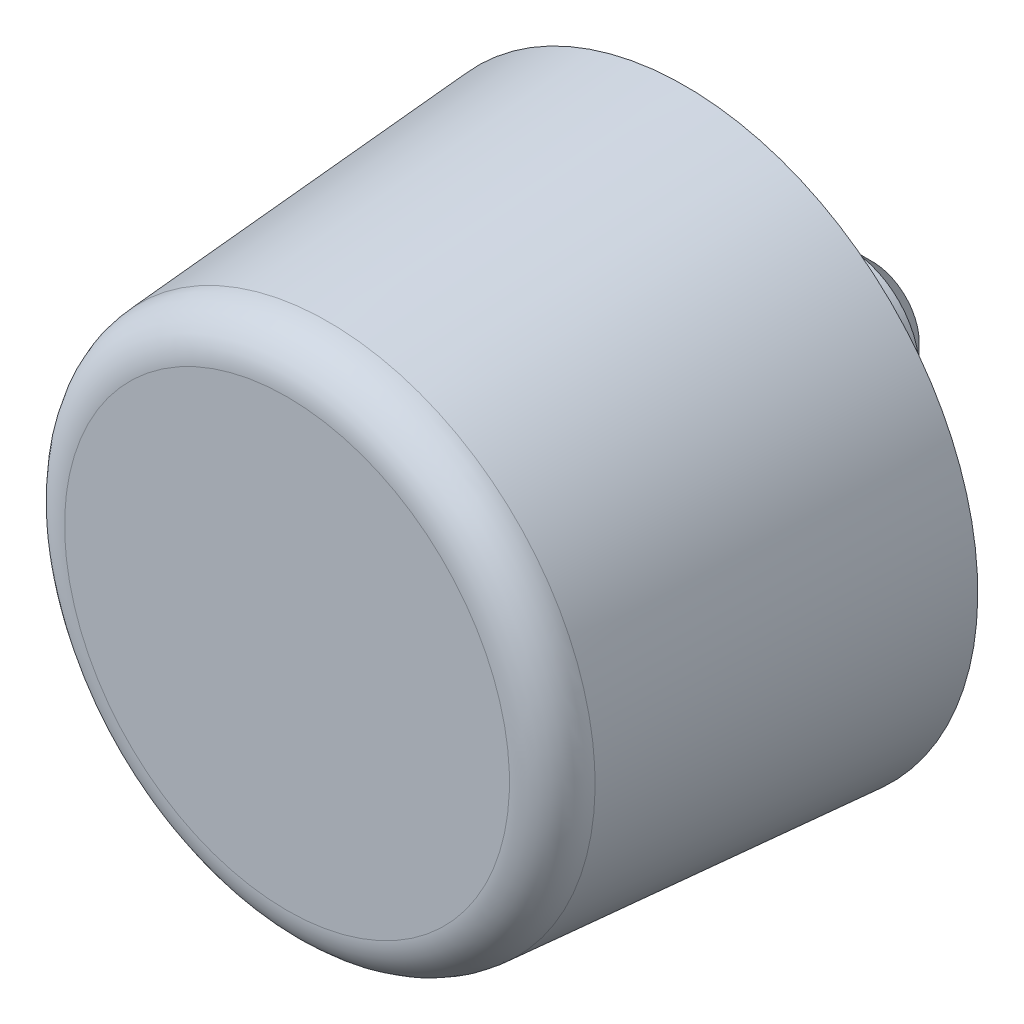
ISO-10303-21;
HEADER;
FILE_DESCRIPTION(('STEP AP214'),'2;1');
FILE_NAME('part.step','',(''),(''),'','','');
FILE_SCHEMA(('AUTOMOTIVE_DESIGN { 1 0 10303 214 1 1 1 1 }'));
ENDSEC;
DATA;
#1=APPLICATION_CONTEXT('core data for automotive mechanical design processes');
#2=APPLICATION_PROTOCOL_DEFINITION('international standard','automotive_design',2000,#1);
#3=PRODUCT_CONTEXT('',#1,'mechanical');
#4=PRODUCT('Part','Part','',(#3));
#5=PRODUCT_RELATED_PRODUCT_CATEGORY('part','',(#4));
#6=PRODUCT_DEFINITION_FORMATION('','',#4);
#7=PRODUCT_DEFINITION_CONTEXT('part definition',#1,'design');
#8=PRODUCT_DEFINITION('design','',#6,#7);
#9=PRODUCT_DEFINITION_SHAPE('','',#8);
#10=(LENGTH_UNIT() NAMED_UNIT(*) SI_UNIT(.MILLI.,.METRE.));
#11=(NAMED_UNIT(*) PLANE_ANGLE_UNIT() SI_UNIT($,.RADIAN.));
#12=(NAMED_UNIT(*) SI_UNIT($,.STERADIAN.) SOLID_ANGLE_UNIT());
#13=UNCERTAINTY_MEASURE_WITH_UNIT(LENGTH_MEASURE(1.E-05),#10,'distance_accuracy_value','');
#14=(GEOMETRIC_REPRESENTATION_CONTEXT(3) GLOBAL_UNCERTAINTY_ASSIGNED_CONTEXT((#13)) GLOBAL_UNIT_ASSIGNED_CONTEXT((#10,
#11,#12)) REPRESENTATION_CONTEXT('',''));
#15=CARTESIAN_POINT('',(0.,0.,0.));
#16=DIRECTION('',(0.,0.,1.));
#17=DIRECTION('',(1.,0.,0.));
#18=AXIS2_PLACEMENT_3D('',#15,#16,#17);
#19=CARTESIAN_POINT('',(0.,0.,17.));
#20=DIRECTION('',(0.,0.,1.));
#21=DIRECTION('',(0.,-1.,0.));
#22=AXIS2_PLACEMENT_3D('',#19,#20,#21);
#23=CYLINDRICAL_SURFACE('',#22,11.25);
#24=CARTESIAN_POINT('',(0.,0.,0.));
#25=DIRECTION('',(0.,0.,1.));
#26=DIRECTION('',(0.,-1.,0.));
#27=AXIS2_PLACEMENT_3D('',#24,#25,#26);
#28=CIRCLE('',#27,11.25);
#29=CARTESIAN_POINT('',(0.,-11.25,0.));
#30=VERTEX_POINT('',#29);
#31=EDGE_CURVE('E27',#30,#30,#28,.T.);
#32=ORIENTED_EDGE('',*,*,#31,.F.);
#33=EDGE_LOOP('',(#32));
#34=FACE_BOUND('',#33,.T.);
#35=CARTESIAN_POINT('',(0.,0.,0.0500000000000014));
#36=DIRECTION('',(0.,0.,1.));
#37=DIRECTION('',(0.,-1.,0.));
#38=AXIS2_PLACEMENT_3D('',#35,#36,#37);
#39=CIRCLE('',#38,11.25);
#40=CARTESIAN_POINT('',(0.,-11.25,0.0500000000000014));
#41=VERTEX_POINT('',#40);
#42=EDGE_CURVE('E44',#41,#41,#39,.T.);
#43=ORIENTED_EDGE('',*,*,#42,.T.);
#44=EDGE_LOOP('',(#43));
#45=FACE_BOUND('',#44,.T.);
#46=ADVANCED_FACE('F12',(#34,#45),#23,.F.);
#47=CARTESIAN_POINT('',(11.25,0.,0.));
#48=DIRECTION('',(0.,0.,1.));
#49=DIRECTION('',(0.,-1.,0.));
#50=AXIS2_PLACEMENT_3D('',#47,#48,#49);
#51=PLANE('',#50);
#52=CARTESIAN_POINT('',(0.,0.,0.));
#53=DIRECTION('',(0.,0.,1.));
#54=DIRECTION('',(0.,-1.,0.));
#55=AXIS2_PLACEMENT_3D('',#52,#53,#54);
#56=CIRCLE('',#55,12.5);
#57=CARTESIAN_POINT('',(0.,-12.5,0.));
#58=VERTEX_POINT('',#57);
#59=EDGE_CURVE('E32',#58,#58,#56,.T.);
#60=ORIENTED_EDGE('',*,*,#59,.F.);
#61=EDGE_LOOP('',(#60));
#62=FACE_BOUND('',#61,.T.);
#63=ORIENTED_EDGE('',*,*,#31,.T.);
#64=EDGE_LOOP('',(#63));
#65=FACE_BOUND('',#64,.T.);
#66=ADVANCED_FACE('F72',(#62,#65),#51,.F.);
#67=CARTESIAN_POINT('',(0.,0.,0.));
#68=DIRECTION('',(0.,0.,-1.));
#69=DIRECTION('',(0.,1.,0.));
#70=AXIS2_PLACEMENT_3D('',#67,#68,#69);
#71=CONICAL_SURFACE('',#70,12.5,0.0723905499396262);
#72=CARTESIAN_POINT('',(0.,0.,15.2374219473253));
#73=DIRECTION('',(0.,0.,1.));
#74=DIRECTION('',(0.,-1.,0.));
#75=AXIS2_PLACEMENT_3D('',#72,#73,#74);
#76=CIRCLE('',#75,11.3950238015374);
#77=CARTESIAN_POINT('',(0.,-11.3950238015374,15.2374219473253));
#78=VERTEX_POINT('',#77);
#79=EDGE_CURVE('E35',#78,#78,#76,.T.);
#80=ORIENTED_EDGE('',*,*,#79,.F.);
#81=EDGE_LOOP('',(#80));
#82=FACE_BOUND('',#81,.T.);
#83=ORIENTED_EDGE('',*,*,#59,.T.);
#84=EDGE_LOOP('',(#83));
#85=FACE_BOUND('',#84,.T.);
#86=ADVANCED_FACE('F77',(#82,#85),#71,.T.);
#87=CARTESIAN_POINT('',(0.,0.,15.1));
#88=DIRECTION('',(0.,0.,1.));
#89=DIRECTION('',(0.,-1.,0.));
#90=AXIS2_PLACEMENT_3D('',#87,#88,#89);
#91=TOROIDAL_SURFACE('',#90,9.5,1.9);
#92=ORIENTED_EDGE('',*,*,#79,.T.);
#93=EDGE_LOOP('',(#92));
#94=FACE_BOUND('',#93,.T.);
#95=CARTESIAN_POINT('',(0.,0.,17.));
#96=DIRECTION('',(0.,0.,1.));
#97=DIRECTION('',(0.,-1.,0.));
#98=AXIS2_PLACEMENT_3D('',#95,#96,#97);
#99=CIRCLE('',#98,9.5);
#100=CARTESIAN_POINT('',(0.,-9.5,17.));
#101=VERTEX_POINT('',#100);
#102=EDGE_CURVE('E38',#101,#101,#99,.T.);
#103=ORIENTED_EDGE('',*,*,#102,.F.);
#104=EDGE_LOOP('',(#103));
#105=FACE_BOUND('',#104,.T.);
#106=ADVANCED_FACE('F84',(#94,#105),#91,.T.);
#107=CARTESIAN_POINT('',(9.5,0.,17.));
#108=DIRECTION('',(0.,0.,-1.));
#109=DIRECTION('',(0.,1.,0.));
#110=AXIS2_PLACEMENT_3D('',#107,#108,#109);
#111=PLANE('',#110);
#112=ORIENTED_EDGE('',*,*,#102,.T.);
#113=EDGE_LOOP('',(#112));
#114=FACE_BOUND('',#113,.T.);
#115=ADVANCED_FACE('F59',(#114),#111,.F.);
#116=CARTESIAN_POINT('',(0.,0.,0.));
#117=DIRECTION('',(0.,0.,1.));
#118=DIRECTION('',(0.,-1.,0.));
#119=AXIS2_PLACEMENT_3D('',#116,#117,#118);
#120=PLANE('',#119);
#121=CARTESIAN_POINT('',(0.,0.,0.));
#122=DIRECTION('',(0.,0.,1.));
#123=DIRECTION('',(0.,-1.,0.));
#124=AXIS2_PLACEMENT_3D('',#121,#122,#123);
#125=CIRCLE('',#124,11.2);
#126=CARTESIAN_POINT('',(0.,-11.2,0.));
#127=VERTEX_POINT('',#126);
#128=EDGE_CURVE('E41',#127,#127,#125,.T.);
#129=ORIENTED_EDGE('',*,*,#128,.F.);
#130=EDGE_LOOP('',(#129));
#131=FACE_BOUND('',#130,.T.);
#132=CARTESIAN_POINT('',(0.,0.,0.));
#133=DIRECTION('',(0.,0.,1.));
#134=DIRECTION('',(0.,-1.,0.));
#135=AXIS2_PLACEMENT_3D('',#132,#133,#134);
#136=CIRCLE('',#135,3.);
#137=CARTESIAN_POINT('',(0.,-3.,0.));
#138=VERTEX_POINT('',#137);
#139=EDGE_CURVE('E23',#138,#138,#136,.T.);
#140=ORIENTED_EDGE('',*,*,#139,.T.);
#141=EDGE_LOOP('',(#140));
#142=FACE_BOUND('',#141,.T.);
#143=ADVANCED_FACE('F53',(#131,#142),#120,.F.);
#144=CARTESIAN_POINT('',(0.,0.,0.));
#145=DIRECTION('',(0.,0.,1.));
#146=DIRECTION('',(0.,-1.,0.));
#147=AXIS2_PLACEMENT_3D('',#144,#145,#146);
#148=CONICAL_SURFACE('',#147,11.2,0.785398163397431);
#149=ORIENTED_EDGE('',*,*,#42,.F.);
#150=EDGE_LOOP('',(#149));
#151=FACE_BOUND('',#150,.T.);
#152=ORIENTED_EDGE('',*,*,#128,.T.);
#153=EDGE_LOOP('',(#152));
#154=FACE_BOUND('',#153,.T.);
#155=ADVANCED_FACE('F49',(#151,#154),#148,.T.);
#156=CARTESIAN_POINT('',(0.,0.,17.));
#157=DIRECTION('',(0.,0.,1.));
#158=DIRECTION('',(0.,-1.,0.));
#159=AXIS2_PLACEMENT_3D('',#156,#157,#158);
#160=CYLINDRICAL_SURFACE('',#159,3.);
#161=CARTESIAN_POINT('',(0.,0.,-7.));
#162=DIRECTION('',(0.,0.,1.));
#163=DIRECTION('',(0.,-1.,0.));
#164=AXIS2_PLACEMENT_3D('',#161,#162,#163);
#165=CIRCLE('',#164,3.);
#166=CARTESIAN_POINT('',(0.,-3.,-7.));
#167=VERTEX_POINT('',#166);
#168=EDGE_CURVE('E8',#167,#167,#165,.T.);
#169=ORIENTED_EDGE('',*,*,#168,.T.);
#170=EDGE_LOOP('',(#169));
#171=FACE_BOUND('',#170,.T.);
#172=ORIENTED_EDGE('',*,*,#139,.F.);
#173=EDGE_LOOP('',(#172));
#174=FACE_BOUND('',#173,.T.);
#175=ADVANCED_FACE('F52',(#171,#174),#160,.T.);
#176=CARTESIAN_POINT('',(0.,0.,-8.));
#177=DIRECTION('',(0.,0.,1.));
#178=DIRECTION('',(0.,-1.,0.));
#179=AXIS2_PLACEMENT_3D('',#176,#177,#178);
#180=PLANE('',#179);
#181=CARTESIAN_POINT('',(0.,0.,-8.));
#182=DIRECTION('',(0.,0.,1.));
#183=DIRECTION('',(0.,-1.,0.));
#184=AXIS2_PLACEMENT_3D('',#181,#182,#183);
#185=CIRCLE('',#184,2.);
#186=CARTESIAN_POINT('',(0.,-2.,-8.));
#187=VERTEX_POINT('',#186);
#188=EDGE_CURVE('E19',#187,#187,#185,.F.);
#189=ORIENTED_EDGE('',*,*,#188,.T.);
#190=EDGE_LOOP('',(#189));
#191=FACE_BOUND('',#190,.T.);
#192=ADVANCED_FACE('F64',(#191),#180,.F.);
#193=CARTESIAN_POINT('',(0.,0.,-8.));
#194=DIRECTION('',(0.,0.,1.));
#195=DIRECTION('',(0.,-1.,0.));
#196=AXIS2_PLACEMENT_3D('',#193,#194,#195);
#197=CONICAL_SURFACE('',#196,2.,0.785398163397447);
#198=ORIENTED_EDGE('',*,*,#168,.F.);
#199=EDGE_LOOP('',(#198));
#200=FACE_BOUND('',#199,.T.);
#201=ORIENTED_EDGE('',*,*,#188,.F.);
#202=EDGE_LOOP('',(#201));
#203=FACE_BOUND('',#202,.T.);
#204=ADVANCED_FACE('F14',(#200,#203),#197,.T.);
#205=CLOSED_SHELL('',(#46,#66,#86,#106,#115,#143,#155,#175,#192,#204));
#206=MANIFOLD_SOLID_BREP('B1',#205);
#207=ADVANCED_BREP_SHAPE_REPRESENTATION('',(#18,#206),#14);
#208=SHAPE_DEFINITION_REPRESENTATION(#9,#207);
ENDSEC;
END-ISO-10303-21;
